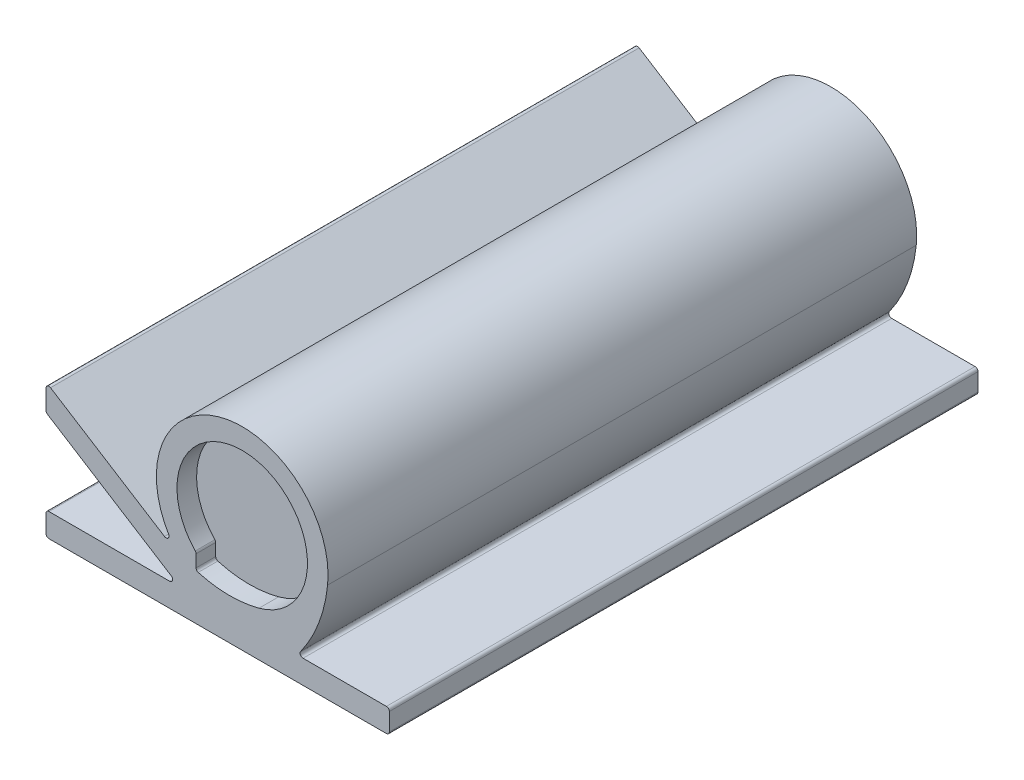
from build123d import *

# Parameters (mm, degrees)
BOSS_EXTRUDE1_DEPTH = 60
CUT_EXTRUDE1_DEPTH  = 2
FILLET1_R           = 0.3


with BuildPart() as part:
    # Sketch1 → Boss-Extrude1 (new body)
    with BuildSketch(Plane.XY):
        with BuildLine():
            Line((-20, 0), (15, 0))
            Line((15, 0), (15, 2.4))
            Line((15, 2.4), (5.6, 2.4))
            ThreePointArc((5.6, 2.4), (7.69623384, 6.033789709), (8.704206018, 10.105965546))
            ThreePointArc((8.704206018, 10.105965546), (-2.640539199, 19.342065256), (-6.604405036, 5.260284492))
            Line((-6.604405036, 5.260284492), (-20, 13.7))
            Line((-20, 13.7), (-20, 11))
            Line((-20, 11), (-6.35, 2.4))
            Line((-6.35, 2.4), (-20, 2.4))
            Line((-20, 2.4), (-20, 0))
        make_face()
    extrude(amount=BOSS_EXTRUDE1_DEPTH)

    # Sketch2 → Cut-Extrude1 (cut)
    with BuildSketch(Plane.XY.offset(60)):
        with BuildLine():
            Line((-4.7, 6.295480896), (-4.7, 4.7))
            ThreePointArc((-4.7, 4.7), (-1.502251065, 4.185136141), (1.713196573, 4.57446831))
            ThreePointArc((1.713196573, 4.57446831), (1.723577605, 17.422754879), (-4.7, 6.295480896))
        make_face()
    extrude(amount=-CUT_EXTRUDE1_DEPTH, mode=Mode.SUBTRACT)

    # Fillet1
    fillet1_edges = [part.edges().sort_by_distance(p)[0] for p in [
        (-20, 2.4, 30),
        (-6.35, 2.4, 30),
        (-20, 11, 30),
        (-20, 13.7, 30),
        (-6.604405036, 5.260284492, 30),
        (5.6, 2.4, 30),
        (15, 2.4, 30),
        (15, 0, 30),
        (-20, 0, 30),
        (-4.7, 6.295480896, 59),
        (-4.7, 4.7, 59),
    ]]
    fillet(fillet1_edges, radius=FILLET1_R)


solid = part.part
